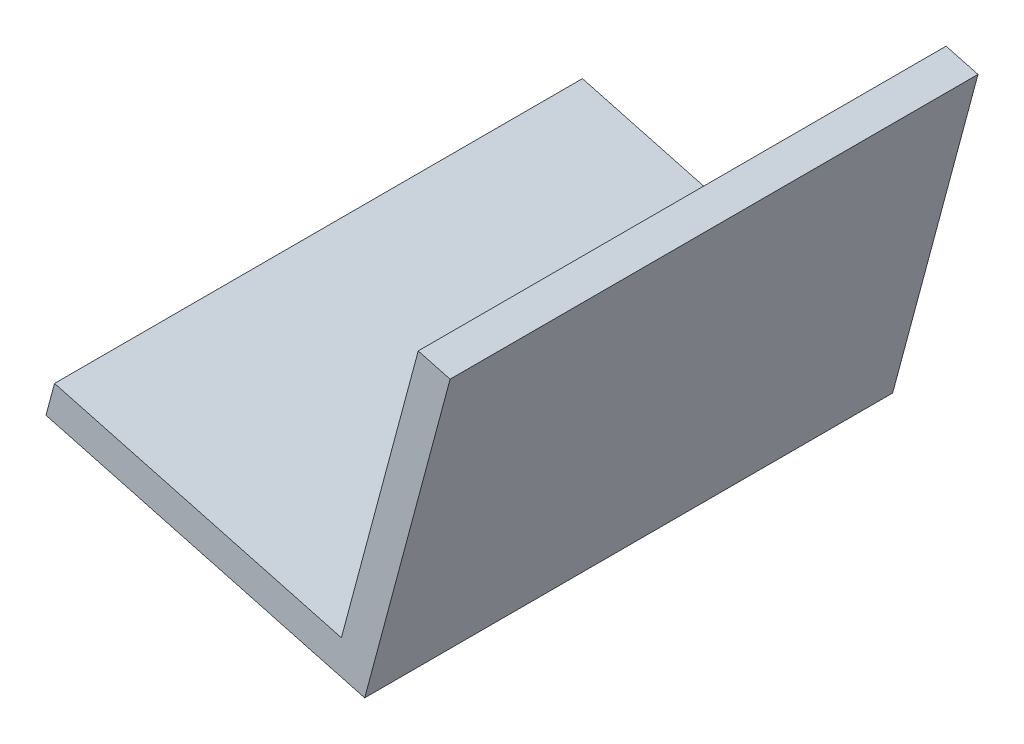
ISO-10303-21;
HEADER;
FILE_DESCRIPTION(('STEP AP214'),'2;1');
FILE_NAME('part.step','',(''),(''),'','','');
FILE_SCHEMA(('AUTOMOTIVE_DESIGN { 1 0 10303 214 1 1 1 1 }'));
ENDSEC;
DATA;
#1=APPLICATION_CONTEXT('core data for automotive mechanical design processes');
#2=APPLICATION_PROTOCOL_DEFINITION('international standard','automotive_design',2000,#1);
#3=PRODUCT_CONTEXT('',#1,'mechanical');
#4=PRODUCT('Part','Part','',(#3));
#5=PRODUCT_RELATED_PRODUCT_CATEGORY('part','',(#4));
#6=PRODUCT_DEFINITION_FORMATION('','',#4);
#7=PRODUCT_DEFINITION_CONTEXT('part definition',#1,'design');
#8=PRODUCT_DEFINITION('design','',#6,#7);
#9=PRODUCT_DEFINITION_SHAPE('','',#8);
#10=(LENGTH_UNIT() NAMED_UNIT(*) SI_UNIT(.MILLI.,.METRE.));
#11=(NAMED_UNIT(*) PLANE_ANGLE_UNIT() SI_UNIT($,.RADIAN.));
#12=(NAMED_UNIT(*) SI_UNIT($,.STERADIAN.) SOLID_ANGLE_UNIT());
#13=UNCERTAINTY_MEASURE_WITH_UNIT(LENGTH_MEASURE(1.E-05),#10,'distance_accuracy_value','');
#14=(GEOMETRIC_REPRESENTATION_CONTEXT(3) GLOBAL_UNCERTAINTY_ASSIGNED_CONTEXT((#13)) GLOBAL_UNIT_ASSIGNED_CONTEXT((#10,
#11,#12)) REPRESENTATION_CONTEXT('',''));
#15=CARTESIAN_POINT('',(0.,0.,0.));
#16=DIRECTION('',(0.,0.,1.));
#17=DIRECTION('',(1.,0.,0.));
#18=AXIS2_PLACEMENT_3D('',#15,#16,#17);
#19=CARTESIAN_POINT('',(3656.34543873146,3481.81236238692,-80.));
#20=DIRECTION('',(-0.965925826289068,0.258819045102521,0.));
#21=DIRECTION('',(-0.258819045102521,-0.965925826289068,0.));
#22=AXIS2_PLACEMENT_3D('',#19,#20,#21);
#23=PLANE('',#22);
#24=DIRECTION('',(-0.258819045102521,-0.965925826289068,0.));
#25=VECTOR('',#24,1.);
#26=CARTESIAN_POINT('',(3656.34543873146,3481.81236238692,0.));
#27=LINE('',#26,#25);
#28=CARTESIAN_POINT('',(3667.99229576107,3525.27902456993,0.));
#29=VERTEX_POINT('',#28);
#30=CARTESIAN_POINT('',(3656.34543873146,3481.81236238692,0.));
#31=VERTEX_POINT('',#30);
#32=EDGE_CURVE('E76',#29,#31,#27,.T.);
#33=ORIENTED_EDGE('',*,*,#32,.F.);
#34=DIRECTION('',(0.,0.,1.));
#35=VECTOR('',#34,1.);
#36=CARTESIAN_POINT('',(3667.99229576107,3525.27902456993,-80.));
#37=LINE('',#36,#35);
#38=CARTESIAN_POINT('',(3667.99229576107,3525.27902456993,-80.));
#39=VERTEX_POINT('',#38);
#40=EDGE_CURVE('E11',#39,#29,#37,.T.);
#41=ORIENTED_EDGE('',*,*,#40,.F.);
#42=DIRECTION('',(-0.258819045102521,-0.965925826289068,0.));
#43=VECTOR('',#42,1.);
#44=CARTESIAN_POINT('',(3656.34543873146,3481.81236238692,-80.));
#45=LINE('',#44,#43);
#46=CARTESIAN_POINT('',(3656.34543873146,3481.81236238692,-80.));
#47=VERTEX_POINT('',#46);
#48=EDGE_CURVE('E78',#39,#47,#45,.T.);
#49=ORIENTED_EDGE('',*,*,#48,.T.);
#50=DIRECTION('',(0.,0.,1.));
#51=VECTOR('',#50,1.);
#52=CARTESIAN_POINT('',(3656.34543873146,3481.81236238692,-80.));
#53=LINE('',#52,#51);
#54=EDGE_CURVE('E27',#47,#31,#53,.T.);
#55=ORIENTED_EDGE('',*,*,#54,.T.);
#56=EDGE_LOOP('',(#33,#41,#49,#55));
#57=FACE_BOUND('',#56,.T.);
#58=ADVANCED_FACE('F24',(#57),#23,.T.);
#59=CARTESIAN_POINT('',(3667.99229576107,3525.27902456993,-80.));
#60=DIRECTION('',(0.258819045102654,0.965925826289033,0.));
#61=DIRECTION('',(-0.965925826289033,0.258819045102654,0.));
#62=AXIS2_PLACEMENT_3D('',#59,#60,#61);
#63=PLANE('',#62);
#64=DIRECTION('',(-0.965925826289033,0.258819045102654,0.));
#65=VECTOR('',#64,1.);
#66=CARTESIAN_POINT('',(3667.99229576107,3525.27902456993,0.));
#67=LINE('',#66,#65);
#68=CARTESIAN_POINT('',(3672.82192489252,3523.98492934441,0.));
#69=VERTEX_POINT('',#68);
#70=EDGE_CURVE('E94',#69,#29,#67,.T.);
#71=ORIENTED_EDGE('',*,*,#70,.F.);
#72=DIRECTION('',(0.,0.,1.));
#73=VECTOR('',#72,1.);
#74=CARTESIAN_POINT('',(3672.82192489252,3523.98492934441,-80.));
#75=LINE('',#74,#73);
#76=CARTESIAN_POINT('',(3672.82192489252,3523.98492934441,-80.));
#77=VERTEX_POINT('',#76);
#78=EDGE_CURVE('E32',#77,#69,#75,.T.);
#79=ORIENTED_EDGE('',*,*,#78,.F.);
#80=DIRECTION('',(-0.965925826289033,0.258819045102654,0.));
#81=VECTOR('',#80,1.);
#82=CARTESIAN_POINT('',(3667.99229576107,3525.27902456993,-80.));
#83=LINE('',#82,#81);
#84=EDGE_CURVE('E83',#77,#39,#83,.T.);
#85=ORIENTED_EDGE('',*,*,#84,.T.);
#86=ORIENTED_EDGE('',*,*,#40,.T.);
#87=EDGE_LOOP('',(#71,#79,#85,#86));
#88=FACE_BOUND('',#87,.T.);
#89=ADVANCED_FACE('F129',(#88),#63,.T.);
#90=CARTESIAN_POINT('',(3672.82192489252,3523.98492934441,-80.));
#91=DIRECTION('',(0.965925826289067,-0.258819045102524,0.));
#92=DIRECTION('',(0.258819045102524,0.965925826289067,0.));
#93=AXIS2_PLACEMENT_3D('',#90,#91,#92);
#94=PLANE('',#93);
#95=DIRECTION('',(0.258819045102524,0.965925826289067,0.));
#96=VECTOR('',#95,1.);
#97=CARTESIAN_POINT('',(3672.82192489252,3523.98492934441,0.));
#98=LINE('',#97,#96);
#99=CARTESIAN_POINT('',(3659.88097263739,3475.68863802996,0.));
#100=VERTEX_POINT('',#99);
#101=EDGE_CURVE('E101',#100,#69,#98,.T.);
#102=ORIENTED_EDGE('',*,*,#101,.F.);
#103=DIRECTION('',(0.,0.,1.));
#104=VECTOR('',#103,1.);
#105=CARTESIAN_POINT('',(3659.88097263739,3475.68863802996,-80.));
#106=LINE('',#105,#104);
#107=CARTESIAN_POINT('',(3659.88097263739,3475.68863802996,-80.));
#108=VERTEX_POINT('',#107);
#109=EDGE_CURVE('E117',#108,#100,#106,.T.);
#110=ORIENTED_EDGE('',*,*,#109,.F.);
#111=DIRECTION('',(0.258819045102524,0.965925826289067,0.));
#112=VECTOR('',#111,1.);
#113=CARTESIAN_POINT('',(3672.82192489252,3523.98492934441,-80.));
#114=LINE('',#113,#112);
#115=EDGE_CURVE('E113',#108,#77,#114,.T.);
#116=ORIENTED_EDGE('',*,*,#115,.T.);
#117=ORIENTED_EDGE('',*,*,#78,.T.);
#118=EDGE_LOOP('',(#102,#110,#116,#117));
#119=FACE_BOUND('',#118,.T.);
#120=ADVANCED_FACE('F134',(#119),#94,.T.);
#121=CARTESIAN_POINT('',(3659.88097263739,3475.68863802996,-80.));
#122=DIRECTION('',(-0.258819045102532,-0.965925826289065,0.));
#123=DIRECTION('',(0.965925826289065,-0.258819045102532,0.));
#124=AXIS2_PLACEMENT_3D('',#121,#122,#123);
#125=PLANE('',#124);
#126=DIRECTION('',(0.965925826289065,-0.258819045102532,0.));
#127=VECTOR('',#126,1.);
#128=CARTESIAN_POINT('',(3659.88097263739,3475.68863802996,0.));
#129=LINE('',#128,#127);
#130=CARTESIAN_POINT('',(3611.58468132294,3488.62959028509,0.));
#131=VERTEX_POINT('',#130);
#132=EDGE_CURVE('E98',#131,#100,#129,.T.);
#133=ORIENTED_EDGE('',*,*,#132,.F.);
#134=DIRECTION('',(0.,0.,1.));
#135=VECTOR('',#134,1.);
#136=CARTESIAN_POINT('',(3611.58468132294,3488.62959028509,-80.));
#137=LINE('',#136,#135);
#138=CARTESIAN_POINT('',(3611.58468132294,3488.62959028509,-80.));
#139=VERTEX_POINT('',#138);
#140=EDGE_CURVE('E119',#139,#131,#137,.T.);
#141=ORIENTED_EDGE('',*,*,#140,.F.);
#142=DIRECTION('',(0.965925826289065,-0.258819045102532,0.));
#143=VECTOR('',#142,1.);
#144=CARTESIAN_POINT('',(3659.88097263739,3475.68863802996,-80.));
#145=LINE('',#144,#143);
#146=EDGE_CURVE('E110',#139,#108,#145,.T.);
#147=ORIENTED_EDGE('',*,*,#146,.T.);
#148=ORIENTED_EDGE('',*,*,#109,.T.);
#149=EDGE_LOOP('',(#133,#141,#147,#148));
#150=FACE_BOUND('',#149,.T.);
#151=ADVANCED_FACE('F126',(#150),#125,.T.);
#152=CARTESIAN_POINT('',(3611.58468132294,3488.62959028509,-80.));
#153=DIRECTION('',(-0.965925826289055,0.258819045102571,0.));
#154=DIRECTION('',(-0.258819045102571,-0.965925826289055,0.));
#155=AXIS2_PLACEMENT_3D('',#152,#153,#154);
#156=PLANE('',#155);
#157=DIRECTION('',(-0.258819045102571,-0.965925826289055,0.));
#158=VECTOR('',#157,1.);
#159=CARTESIAN_POINT('',(3611.58468132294,3488.62959028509,0.));
#160=LINE('',#159,#158);
#161=CARTESIAN_POINT('',(3612.87877654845,3493.45921941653,0.));
#162=VERTEX_POINT('',#161);
#163=EDGE_CURVE('E90',#162,#131,#160,.T.);
#164=ORIENTED_EDGE('',*,*,#163,.F.);
#165=DIRECTION('',(0.,0.,1.));
#166=VECTOR('',#165,1.);
#167=CARTESIAN_POINT('',(3612.87877654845,3493.45921941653,-80.));
#168=LINE('',#167,#166);
#169=CARTESIAN_POINT('',(3612.87877654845,3493.45921941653,-80.));
#170=VERTEX_POINT('',#169);
#171=EDGE_CURVE('E82',#170,#162,#168,.T.);
#172=ORIENTED_EDGE('',*,*,#171,.F.);
#173=DIRECTION('',(-0.258819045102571,-0.965925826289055,0.));
#174=VECTOR('',#173,1.);
#175=CARTESIAN_POINT('',(3611.58468132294,3488.62959028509,-80.));
#176=LINE('',#175,#174);
#177=EDGE_CURVE('E107',#170,#139,#176,.T.);
#178=ORIENTED_EDGE('',*,*,#177,.T.);
#179=ORIENTED_EDGE('',*,*,#140,.T.);
#180=EDGE_LOOP('',(#164,#172,#178,#179));
#181=FACE_BOUND('',#180,.T.);
#182=ADVANCED_FACE('F122',(#181),#156,.T.);
#183=CARTESIAN_POINT('',(3612.87877654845,3493.45921941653,-80.));
#184=DIRECTION('',(0.258819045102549,0.965925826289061,0.));
#185=DIRECTION('',(-0.965925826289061,0.258819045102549,0.));
#186=AXIS2_PLACEMENT_3D('',#183,#184,#185);
#187=PLANE('',#186);
#188=DIRECTION('',(-0.965925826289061,0.258819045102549,0.));
#189=VECTOR('',#188,1.);
#190=CARTESIAN_POINT('',(3612.87877654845,3493.45921941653,0.));
#191=LINE('',#190,#189);
#192=EDGE_CURVE('E85',#31,#162,#191,.T.);
#193=ORIENTED_EDGE('',*,*,#192,.F.);
#194=ORIENTED_EDGE('',*,*,#54,.F.);
#195=DIRECTION('',(-0.965925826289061,0.258819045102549,0.));
#196=VECTOR('',#195,1.);
#197=CARTESIAN_POINT('',(3612.87877654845,3493.45921941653,-80.));
#198=LINE('',#197,#196);
#199=EDGE_CURVE('E105',#47,#170,#198,.T.);
#200=ORIENTED_EDGE('',*,*,#199,.T.);
#201=ORIENTED_EDGE('',*,*,#171,.T.);
#202=EDGE_LOOP('',(#193,#194,#200,#201));
#203=FACE_BOUND('',#202,.T.);
#204=ADVANCED_FACE('F86',(#203),#187,.T.);
#205=CARTESIAN_POINT('',(3655.05134350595,3476.98273325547,-80.));
#206=DIRECTION('',(0.,0.,1.));
#207=DIRECTION('',(1.,0.,0.));
#208=AXIS2_PLACEMENT_3D('',#205,#206,#207);
#209=PLANE('',#208);
#210=ORIENTED_EDGE('',*,*,#48,.F.);
#211=ORIENTED_EDGE('',*,*,#84,.F.);
#212=ORIENTED_EDGE('',*,*,#115,.F.);
#213=ORIENTED_EDGE('',*,*,#146,.F.);
#214=ORIENTED_EDGE('',*,*,#177,.F.);
#215=ORIENTED_EDGE('',*,*,#199,.F.);
#216=EDGE_LOOP('',(#210,#211,#212,#213,#214,#215));
#217=FACE_BOUND('',#216,.T.);
#218=ADVANCED_FACE('F133',(#217),#209,.F.);
#219=CARTESIAN_POINT('',(3655.05134350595,3476.98273325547,0.));
#220=DIRECTION('',(0.,0.,1.));
#221=DIRECTION('',(1.,0.,0.));
#222=AXIS2_PLACEMENT_3D('',#219,#220,#221);
#223=PLANE('',#222);
#224=ORIENTED_EDGE('',*,*,#32,.T.);
#225=ORIENTED_EDGE('',*,*,#192,.T.);
#226=ORIENTED_EDGE('',*,*,#163,.T.);
#227=ORIENTED_EDGE('',*,*,#132,.T.);
#228=ORIENTED_EDGE('',*,*,#101,.T.);
#229=ORIENTED_EDGE('',*,*,#70,.T.);
#230=EDGE_LOOP('',(#224,#225,#226,#227,#228,#229));
#231=FACE_BOUND('',#230,.T.);
#232=ADVANCED_FACE('F92',(#231),#223,.T.);
#233=CLOSED_SHELL('',(#58,#89,#120,#151,#182,#204,#218,#232));
#234=MANIFOLD_SOLID_BREP('B2',#233);
#235=ADVANCED_BREP_SHAPE_REPRESENTATION('',(#18,#234),#14);
#236=SHAPE_DEFINITION_REPRESENTATION(#9,#235);
ENDSEC;
END-ISO-10303-21;
